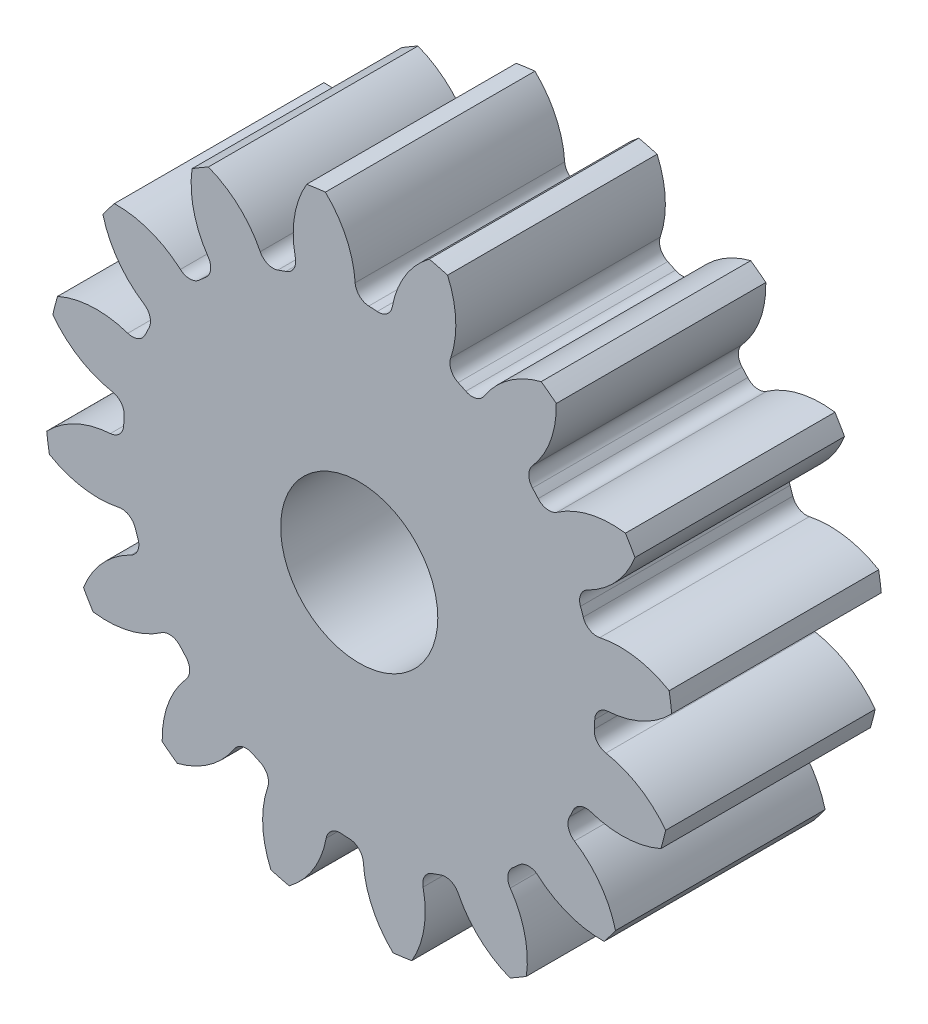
from build123d import *

# Parameters (mm, degrees)
SKETCH3_R         = 152.4
GEARBODY_DEPTH    = 101.6
TOOTHCUT_DEPTH    = 239.273120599
CIRPATTERN1_COUNT = 16
BOREDIA_R         = 38.1
BORE_DEPTH        = 12700


with BuildPart() as part:
    # Sketch3 → gearBody (new body)
    with BuildSketch(Plane.XY):
        Circle(SKETCH3_R)
    extrude(amount=GEARBODY_DEPTH)

    # Sketch2 → toothCut (cut, through all)
    with BuildSketch(Plane.XY):
        with BuildLine():
            ThreePointArc((113.966667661, -8.722881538), (114.105041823, -6.67303758), (114.206549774, -4.62103763))
            ThreePointArc((114.206549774, -4.62103763), (116.160207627, -0.086402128), (120.645658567, 1.977678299))
            ThreePointArc((120.645658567, 1.977678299), (138.026931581, 6.564836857), (152.4, 17.361390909))
            ThreePointArc((152.4, 17.361390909), (153.124090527, -8.9549313), (149.337389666, -35.007455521))
            ThreePointArc((149.337389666, -35.007455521), (136.320794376, -22.609111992), (119.592706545, -16.027185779))
            ThreePointArc((119.592706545, -16.027185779), (115.378430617, -13.454332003), (113.966667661, -8.722881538))
        make_face()
    toothcut = extrude(amount=TOOTHCUT_DEPTH, mode=Mode.SUBTRACT)

    # CirPattern1: toothCut ×16 about axis
    cirpattern1_axis = Axis((0, 0, 0), (0, 0, 1))
    for i in range(1, CIRPATTERN1_COUNT):
        add(toothcut.rotate(cirpattern1_axis, i * 360 / CIRPATTERN1_COUNT), mode=Mode.SUBTRACT)

    # boreDia → bore (cut, symmetric)
    with BuildSketch(Plane.XY):
        Circle(BOREDIA_R)
    extrude(amount=BORE_DEPTH, both=True, mode=Mode.SUBTRACT)


solid = part.part
